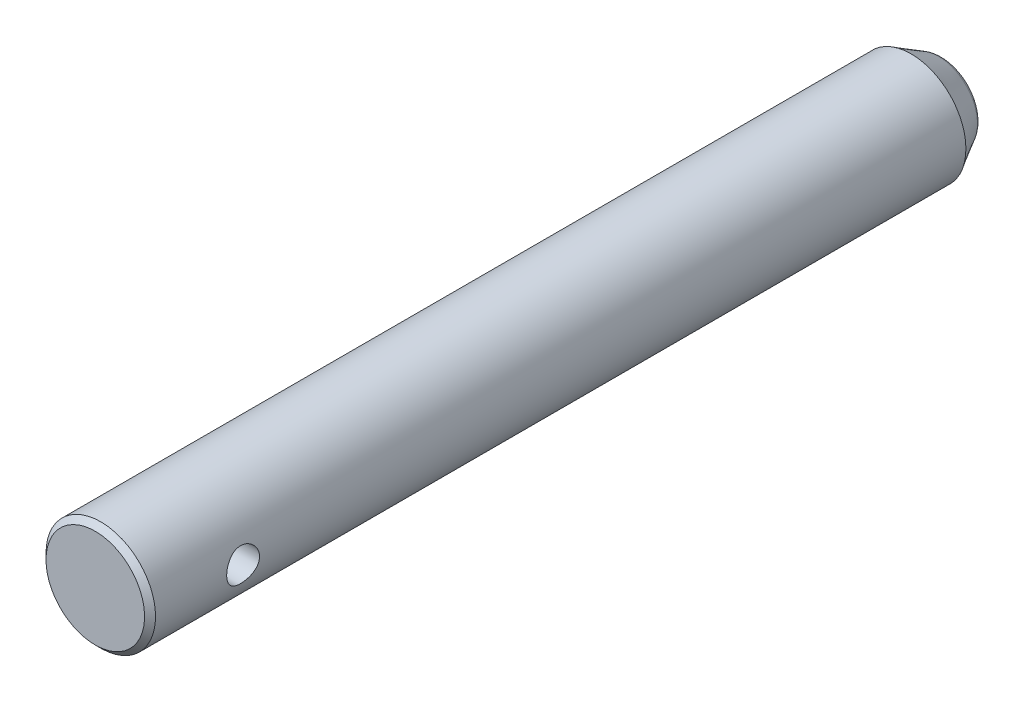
ISO-10303-21;
HEADER;
FILE_DESCRIPTION(('STEP AP214'),'2;1');
FILE_NAME('part.step','',(''),(''),'','','');
FILE_SCHEMA(('AUTOMOTIVE_DESIGN { 1 0 10303 214 1 1 1 1 }'));
ENDSEC;
DATA;
#1=APPLICATION_CONTEXT('core data for automotive mechanical design processes');
#2=APPLICATION_PROTOCOL_DEFINITION('international standard','automotive_design',2000,#1);
#3=PRODUCT_CONTEXT('',#1,'mechanical');
#4=PRODUCT('Part','Part','',(#3));
#5=PRODUCT_RELATED_PRODUCT_CATEGORY('part','',(#4));
#6=PRODUCT_DEFINITION_FORMATION('','',#4);
#7=PRODUCT_DEFINITION_CONTEXT('part definition',#1,'design');
#8=PRODUCT_DEFINITION('design','',#6,#7);
#9=PRODUCT_DEFINITION_SHAPE('','',#8);
#10=(LENGTH_UNIT() NAMED_UNIT(*) SI_UNIT(.MILLI.,.METRE.));
#11=(NAMED_UNIT(*) PLANE_ANGLE_UNIT() SI_UNIT($,.RADIAN.));
#12=(NAMED_UNIT(*) SI_UNIT($,.STERADIAN.) SOLID_ANGLE_UNIT());
#13=UNCERTAINTY_MEASURE_WITH_UNIT(LENGTH_MEASURE(1.E-05),#10,'distance_accuracy_value','');
#14=(GEOMETRIC_REPRESENTATION_CONTEXT(3) GLOBAL_UNCERTAINTY_ASSIGNED_CONTEXT((#13)) GLOBAL_UNIT_ASSIGNED_CONTEXT((#10,
#11,#12)) REPRESENTATION_CONTEXT('',''));
#15=CARTESIAN_POINT('',(0.,0.,0.));
#16=DIRECTION('',(0.,0.,1.));
#17=DIRECTION('',(1.,0.,0.));
#18=AXIS2_PLACEMENT_3D('',#15,#16,#17);
#19=CARTESIAN_POINT('',(0.,0.,-155.));
#20=DIRECTION('',(0.,0.,-1.));
#21=DIRECTION('',(-1.,0.,0.));
#22=AXIS2_PLACEMENT_3D('',#19,#20,#21);
#23=PLANE('',#22);
#24=CARTESIAN_POINT('',(0.,0.,-155.));
#25=DIRECTION('',(0.,0.,1.));
#26=DIRECTION('',(-1.,0.,0.));
#27=AXIS2_PLACEMENT_3D('',#24,#25,#26);
#28=CIRCLE('',#27,5.38119780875);
#29=CARTESIAN_POINT('',(-5.3811978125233,0.,-155.));
#30=VERTEX_POINT('',#29);
#31=CARTESIAN_POINT('',(5.3811978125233,0.,-155.));
#32=VERTEX_POINT('',#31);
#33=EDGE_CURVE('E37',#30,#32,#28,.T.);
#34=ORIENTED_EDGE('',*,*,#33,.F.);
#35=CARTESIAN_POINT('',(0.,0.,-155.));
#36=DIRECTION('',(0.,0.,1.));
#37=DIRECTION('',(1.,0.,0.));
#38=AXIS2_PLACEMENT_3D('',#35,#36,#37);
#39=CIRCLE('',#38,5.38119780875);
#40=EDGE_CURVE('E41',#32,#30,#39,.T.);
#41=ORIENTED_EDGE('',*,*,#40,.F.);
#42=EDGE_LOOP('',(#34,#41));
#43=FACE_BOUND('',#42,.T.);
#44=ADVANCED_FACE('F16',(#43),#23,.T.);
#45=CARTESIAN_POINT('',(0.,0.,-153.));
#46=DIRECTION('',(0.,0.,-1.));
#47=DIRECTION('',(0.999960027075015,-0.00894115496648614,0.));
#48=AXIS2_PLACEMENT_3D('',#45,#46,#47);
#49=TOROIDAL_SURFACE('',#48,5.381197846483,2.);
#50=ORIENTED_EDGE('',*,*,#33,.T.);
#51=ORIENTED_EDGE('',*,*,#40,.T.);
#52=EDGE_LOOP('',(#50,#51));
#53=FACE_BOUND('',#52,.T.);
#54=CARTESIAN_POINT('',(0.,0.,-154.000000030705));
#55=DIRECTION('',(0.,0.,1.));
#56=DIRECTION('',(1.,0.,0.));
#57=AXIS2_PLACEMENT_3D('',#54,#55,#56);
#58=CIRCLE('',#57,7.11324863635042);
#59=CARTESIAN_POINT('',(7.11324863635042,0.,-154.000000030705));
#60=VERTEX_POINT('',#59);
#61=EDGE_CURVE('E47',#60,#60,#58,.T.);
#62=ORIENTED_EDGE('',*,*,#61,.F.);
#63=EDGE_LOOP('',(#62));
#64=FACE_BOUND('',#63,.T.);
#65=ADVANCED_FACE('F39',(#53,#64),#49,.T.);
#66=CARTESIAN_POINT('',(0.,0.,0.));
#67=DIRECTION('',(0.,0.,-1.));
#68=DIRECTION('',(-1.,0.,0.));
#69=AXIS2_PLACEMENT_3D('',#66,#67,#68);
#70=PLANE('',#69);
#71=CARTESIAN_POINT('',(0.,0.,-3.21873874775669E-07));
#72=DIRECTION('',(0.,0.,-1.));
#73=DIRECTION('',(-1.,0.,0.));
#74=AXIS2_PLACEMENT_3D('',#71,#72,#73);
#75=CIRCLE('',#74,8.99999919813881);
#76=CARTESIAN_POINT('',(-8.99999919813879,0.,-3.21873874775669E-07));
#77=VERTEX_POINT('',#76);
#78=EDGE_CURVE('E84',#77,#77,#75,.T.);
#79=ORIENTED_EDGE('',*,*,#78,.F.);
#80=EDGE_LOOP('',(#79));
#81=FACE_BOUND('',#80,.T.);
#82=ADVANCED_FACE('F75',(#81),#70,.F.);
#83=CARTESIAN_POINT('',(3.73205080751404,0.,-17.));
#84=DIRECTION('',(1.,0.,0.));
#85=DIRECTION('',(0.,1.,0.));
#86=AXIS2_PLACEMENT_3D('',#83,#84,#85);
#87=CONICAL_SURFACE('',#86,2.99999999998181,1.04719755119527);
#88=CARTESIAN_POINT('',(1.99999999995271,0.,-16.9999999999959));
#89=VERTEX_POINT('',#88);
#90=VERTEX_LOOP('',#89);
#91=FACE_BOUND('',#90,.T.);
#92=CARTESIAN_POINT('',(3.732050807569,0.,-17.));
#93=DIRECTION('',(1.,0.,0.));
#94=DIRECTION('',(0.,0.,-1.));
#95=AXIS2_PLACEMENT_3D('',#92,#93,#94);
#96=CIRCLE('',#95,3.);
#97=CARTESIAN_POINT('',(3.732050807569,0.,-20.));
#98=VERTEX_POINT('',#97);
#99=EDGE_CURVE('E81',#98,#98,#96,.T.);
#100=ORIENTED_EDGE('',*,*,#99,.T.);
#101=EDGE_LOOP('',(#100));
#102=FACE_BOUND('',#101,.T.);
#103=ADVANCED_FACE('F115',(#91,#102),#87,.F.);
#104=CARTESIAN_POINT('',(0.,0.,-149.000000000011));
#105=DIRECTION('',(0.,0.,1.));
#106=DIRECTION('',(1.,0.,0.));
#107=AXIS2_PLACEMENT_3D('',#104,#105,#106);
#108=CONICAL_SURFACE('',#107,10.0000000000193,0.5235987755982);
#109=CARTESIAN_POINT('',(0.,0.,-149.));
#110=DIRECTION('',(0.,0.,-1.));
#111=DIRECTION('',(-1.,0.,0.));
#112=AXIS2_PLACEMENT_3D('',#109,#110,#111);
#113=CIRCLE('',#112,10.);
#114=CARTESIAN_POINT('',(-10.,0.,-149.));
#115=VERTEX_POINT('',#114);
#116=EDGE_CURVE('E91',#115,#115,#113,.F.);
#117=ORIENTED_EDGE('',*,*,#116,.F.);
#118=EDGE_LOOP('',(#117));
#119=FACE_BOUND('',#118,.T.);
#120=ORIENTED_EDGE('',*,*,#61,.T.);
#121=EDGE_LOOP('',(#120));
#122=FACE_BOUND('',#121,.T.);
#123=ADVANCED_FACE('F107',(#119,#122),#108,.T.);
#124=CARTESIAN_POINT('',(0.,0.,-1.00000089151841));
#125=DIRECTION('',(0.,0.,-1.));
#126=DIRECTION('',(-1.,0.,0.));
#127=AXIS2_PLACEMENT_3D('',#124,#125,#126);
#128=CONICAL_SURFACE('',#127,9.99999964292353,0.785398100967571);
#129=CARTESIAN_POINT('',(0.,0.,-1.000000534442));
#130=DIRECTION('',(0.,0.,-1.));
#131=DIRECTION('',(-1.,0.,0.));
#132=AXIS2_PLACEMENT_3D('',#129,#130,#131);
#133=CIRCLE('',#132,10.);
#134=CARTESIAN_POINT('',(-10.,0.,-1.000000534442));
#135=VERTEX_POINT('',#134);
#136=EDGE_CURVE('E27',#135,#135,#133,.T.);
#137=ORIENTED_EDGE('',*,*,#136,.F.);
#138=EDGE_LOOP('',(#137));
#139=FACE_BOUND('',#138,.T.);
#140=ORIENTED_EDGE('',*,*,#78,.T.);
#141=EDGE_LOOP('',(#140));
#142=FACE_BOUND('',#141,.T.);
#143=ADVANCED_FACE('F104',(#139,#142),#128,.T.);
#144=CARTESIAN_POINT('',(1.5,0.,-17.));
#145=DIRECTION('',(1.,0.,0.));
#146=DIRECTION('',(0.,0.,-1.));
#147=AXIS2_PLACEMENT_3D('',#144,#145,#146);
#148=CYLINDRICAL_SURFACE('',#147,3.);
#149=ORIENTED_EDGE('',*,*,#99,.F.);
#150=EDGE_LOOP('',(#149));
#151=FACE_BOUND('',#150,.T.);
#152=CARTESIAN_POINT('',(10.,0.,-14.));
#153=CARTESIAN_POINT('',(9.99999407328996,0.164364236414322,-14.0000089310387));
#154=CARTESIAN_POINT('',(9.99590322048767,0.328908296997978,-14.0135695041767));
#155=CARTESIAN_POINT('',(9.9799606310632,0.653366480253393,-14.0673818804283));
#156=CARTESIAN_POINT('',(9.96809523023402,0.813271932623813,-14.1076806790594));
#157=CARTESIAN_POINT('',(9.93790838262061,1.12348315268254,-14.2135007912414));
#158=CARTESIAN_POINT('',(9.91960019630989,1.27380789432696,-14.2789703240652));
#159=CARTESIAN_POINT('',(9.87843514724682,1.56129290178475,-14.4330996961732));
#160=CARTESIAN_POINT('',(9.85557909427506,1.69845550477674,-14.5217554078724));
#161=CARTESIAN_POINT('',(9.80701539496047,1.95973946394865,-14.7224452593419));
#162=CARTESIAN_POINT('',(9.78124907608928,2.08342924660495,-14.8350271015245));
#163=CARTESIAN_POINT('',(9.73011807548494,2.31049290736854,-15.0792112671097));
#164=CARTESIAN_POINT('',(9.70475348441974,2.41386225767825,-15.2108178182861));
#165=CARTESIAN_POINT('',(9.65668220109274,2.59960101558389,-15.4929419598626));
#166=CARTESIAN_POINT('',(9.63404799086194,2.68144668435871,-15.6438178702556));
#167=CARTESIAN_POINT('',(9.59487230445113,2.81842825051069,-15.9579795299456));
#168=CARTESIAN_POINT('',(9.57832932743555,2.87357072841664,-16.1212622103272));
#169=CARTESIAN_POINT('',(9.5538174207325,2.95403265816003,-16.4507804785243));
#170=CARTESIAN_POINT('',(9.54562139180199,2.98014390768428,-16.6168053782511));
#171=CARTESIAN_POINT('',(9.53805579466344,3.00427461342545,-16.9510662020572));
#172=CARTESIAN_POINT('',(9.53868409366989,3.00230085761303,-17.1193015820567));
#173=CARTESIAN_POINT('',(9.54849486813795,2.9709395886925,-17.4467673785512));
#174=CARTESIAN_POINT('',(9.55736772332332,2.94254427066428,-17.6061036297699));
#175=CARTESIAN_POINT('',(9.58216703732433,2.86074869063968,-17.9176387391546));
#176=CARTESIAN_POINT('',(9.59809423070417,2.80734582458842,-18.0698368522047));
#177=CARTESIAN_POINT('',(9.6354552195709,2.67631861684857,-18.3652051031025));
#178=CARTESIAN_POINT('',(9.65696160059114,2.59837186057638,-18.5082226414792));
#179=CARTESIAN_POINT('',(9.70302119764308,2.42069837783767,-18.7794716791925));
#180=CARTESIAN_POINT('',(9.7275749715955,2.32096766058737,-18.9077004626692));
#181=CARTESIAN_POINT('',(9.77821549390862,2.09764727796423,-19.1513495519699));
#182=CARTESIAN_POINT('',(9.80432352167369,1.97323765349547,-19.2660150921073));
#183=CARTESIAN_POINT('',(9.85423611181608,1.7065766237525,-19.4730741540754));
#184=CARTESIAN_POINT('',(9.87803968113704,1.56431758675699,-19.5654580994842));
#185=CARTESIAN_POINT('',(9.92088257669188,1.26458300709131,-19.7257915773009));
#186=CARTESIAN_POINT('',(9.93988525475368,1.10700242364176,-19.7935547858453));
#187=CARTESIAN_POINT('',(9.97069163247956,0.782158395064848,-19.9012737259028));
#188=CARTESIAN_POINT('',(9.9825101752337,0.614915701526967,-19.9412868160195));
#189=CARTESIAN_POINT('',(9.99335985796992,0.371824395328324,-19.9778051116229));
#190=CARTESIAN_POINT('',(9.99584304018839,0.297737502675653,-19.9861188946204));
#191=CARTESIAN_POINT('',(9.99916445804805,0.149112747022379,-19.9972183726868));
#192=CARTESIAN_POINT('',(10.0000026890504,0.0745748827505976,-20.000004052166));
#193=CARTESIAN_POINT('',(9.99999407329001,-0.164364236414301,-19.9999910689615));
#194=CARTESIAN_POINT('',(9.99590322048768,-0.328908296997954,-19.9864304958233));
#195=CARTESIAN_POINT('',(9.97996063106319,-0.653366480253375,-19.9326181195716));
#196=CARTESIAN_POINT('',(9.96809523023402,-0.813271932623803,-19.8923193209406));
#197=CARTESIAN_POINT('',(9.93790838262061,-1.12348315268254,-19.7864992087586));
#198=CARTESIAN_POINT('',(9.91960019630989,-1.27380789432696,-19.7210296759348));
#199=CARTESIAN_POINT('',(9.87843514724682,-1.56129290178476,-19.5669003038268));
#200=CARTESIAN_POINT('',(9.85557909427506,-1.69845550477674,-19.4782445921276));
#201=CARTESIAN_POINT('',(9.80701539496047,-1.95973946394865,-19.2775547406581));
#202=CARTESIAN_POINT('',(9.78124907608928,-2.08342924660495,-19.1649728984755));
#203=CARTESIAN_POINT('',(9.73011807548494,-2.31049290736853,-18.9207887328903));
#204=CARTESIAN_POINT('',(9.70475348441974,-2.41386225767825,-18.7891821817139));
#205=CARTESIAN_POINT('',(9.65668220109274,-2.59960101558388,-18.5070580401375));
#206=CARTESIAN_POINT('',(9.63404799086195,-2.68144668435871,-18.3561821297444));
#207=CARTESIAN_POINT('',(9.59487230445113,-2.81842825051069,-18.0420204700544));
#208=CARTESIAN_POINT('',(9.57832932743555,-2.87357072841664,-17.8787377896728));
#209=CARTESIAN_POINT('',(9.5538174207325,-2.95403265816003,-17.5492195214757));
#210=CARTESIAN_POINT('',(9.54562139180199,-2.98014390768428,-17.3831946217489));
#211=CARTESIAN_POINT('',(9.53805579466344,-3.00427461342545,-17.0489337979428));
#212=CARTESIAN_POINT('',(9.53868409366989,-3.00230085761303,-16.8806984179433));
#213=CARTESIAN_POINT('',(9.54849486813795,-2.9709395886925,-16.5532326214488));
#214=CARTESIAN_POINT('',(9.55736772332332,-2.94254427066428,-16.3938963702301));
#215=CARTESIAN_POINT('',(9.58216703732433,-2.86074869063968,-16.0823612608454));
#216=CARTESIAN_POINT('',(9.59809423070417,-2.80734582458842,-15.9301631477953));
#217=CARTESIAN_POINT('',(9.6354552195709,-2.67631861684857,-15.6347948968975));
#218=CARTESIAN_POINT('',(9.65696160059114,-2.59837186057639,-15.4917773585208));
#219=CARTESIAN_POINT('',(9.70302119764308,-2.42069837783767,-15.2205283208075));
#220=CARTESIAN_POINT('',(9.7275749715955,-2.32096766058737,-15.0922995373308));
#221=CARTESIAN_POINT('',(9.77821549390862,-2.09764727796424,-14.8486504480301));
#222=CARTESIAN_POINT('',(9.80432352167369,-1.97323765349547,-14.7339849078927));
#223=CARTESIAN_POINT('',(9.85423611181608,-1.7065766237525,-14.5269258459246));
#224=CARTESIAN_POINT('',(9.87803968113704,-1.56431758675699,-14.4345419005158));
#225=CARTESIAN_POINT('',(9.92088257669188,-1.26458300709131,-14.2742084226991));
#226=CARTESIAN_POINT('',(9.93988525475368,-1.10700242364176,-14.2064452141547));
#227=CARTESIAN_POINT('',(9.97069163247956,-0.782158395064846,-14.0987262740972));
#228=CARTESIAN_POINT('',(9.9825101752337,-0.614915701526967,-14.0587131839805));
#229=CARTESIAN_POINT('',(9.99335985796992,-0.371824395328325,-14.0221948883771));
#230=CARTESIAN_POINT('',(9.9958430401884,-0.297737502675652,-14.0138811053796));
#231=CARTESIAN_POINT('',(9.99916445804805,-0.149112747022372,-14.0027816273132));
#232=CARTESIAN_POINT('',(10.0000026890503,-0.0745748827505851,-13.999995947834));
#233=CARTESIAN_POINT('',(10.,0.,-14.));
#234=B_SPLINE_CURVE_WITH_KNOTS('',3,(#152,#153,#154,#155,#156,#157,#158,#159,#160,#161,#162,
#163,#164,#165,#166,#167,#168,#169,#170,#171,#172,#173,#174,#175,#176,#177,#178,#179,#180,#181,
#182,#183,#184,#185,#186,#187,#188,#189,#190,#191,#192,#193,#194,#195,#196,#197,#198,#199,#200,
#201,#202,#203,#204,#205,#206,#207,#208,#209,#210,#211,#212,#213,#214,#215,#216,#217,#218,#219,
#220,#221,#222,#223,#224,#225,#226,#227,#228,#229,#230,#231,#232,#233),.UNSPECIFIED.,.T.,.F.,(4,
2,2,2,2,2,2,2,2,2,2,2,2,2,2,2,2,2,2,2,2,2,2,2,2,2,2,2,2,2,2,2,2,2,2,2,2,2,2,2,4),(0.,
0.49280574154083,0.98647994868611,1.47914396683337,1.97172034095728,2.47709830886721,
2.98258875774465,3.49943124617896,4.01614630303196,4.51839363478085,5.02051957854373,
5.50451902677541,5.98856888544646,6.47926306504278,6.97004721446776,7.48124851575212,
7.99266913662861,8.507883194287,9.02202912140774,9.24562293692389,9.4692173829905,
9.96202312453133,10.4556973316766,10.9483613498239,11.4409377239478,11.9463156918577,
12.4518061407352,12.9686486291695,13.4853636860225,13.9876110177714,14.4897369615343,
14.9737364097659,15.457786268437,15.9484804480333,16.4392645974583,16.9504658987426,
17.4618865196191,17.9771005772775,18.4912465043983,18.7148403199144,18.938434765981),.UNSPECIFIED.);
#235=CARTESIAN_POINT('',(10.,0.,-14.));
#236=VERTEX_POINT('',#235);
#237=EDGE_CURVE('E10',#236,#236,#234,.T.);
#238=ORIENTED_EDGE('',*,*,#237,.F.);
#239=EDGE_LOOP('',(#238));
#240=FACE_BOUND('',#239,.T.);
#241=ADVANCED_FACE('F106',(#151,#240),#148,.F.);
#242=CARTESIAN_POINT('',(0.,0.,7.75));
#243=DIRECTION('',(0.,0.,-1.));
#244=DIRECTION('',(-1.,0.,0.));
#245=AXIS2_PLACEMENT_3D('',#242,#243,#244);
#246=CYLINDRICAL_SURFACE('',#245,10.);
#247=ORIENTED_EDGE('',*,*,#116,.T.);
#248=EDGE_LOOP('',(#247));
#249=FACE_BOUND('',#248,.T.);
#250=ORIENTED_EDGE('',*,*,#136,.T.);
#251=EDGE_LOOP('',(#250));
#252=FACE_BOUND('',#251,.T.);
#253=ORIENTED_EDGE('',*,*,#237,.T.);
#254=EDGE_LOOP('',(#253));
#255=FACE_BOUND('',#254,.T.);
#256=ADVANCED_FACE('F101',(#249,#252,#255),#246,.T.);
#257=CLOSED_SHELL('',(#44,#65,#82,#103,#123,#143,#241,#256));
#258=MANIFOLD_SOLID_BREP('B1',#257);
#259=ADVANCED_BREP_SHAPE_REPRESENTATION('',(#18,#258),#14);
#260=SHAPE_DEFINITION_REPRESENTATION(#9,#259);
ENDSEC;
END-ISO-10303-21;
